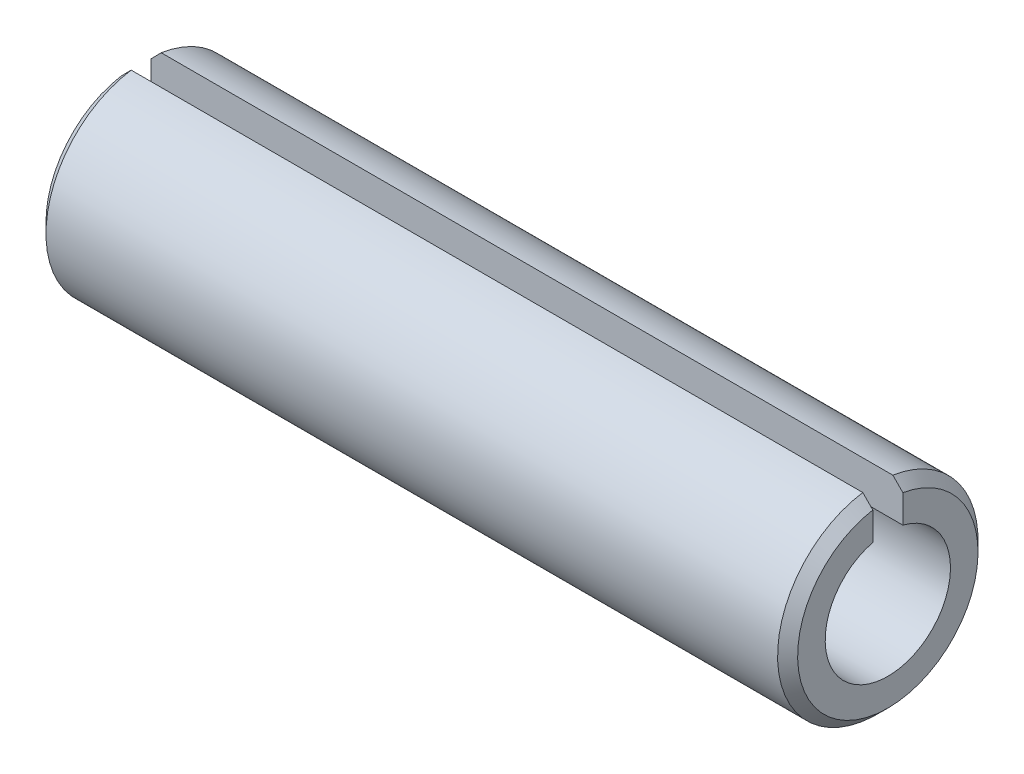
ISO-10303-21;
HEADER;
FILE_DESCRIPTION(('STEP AP214'),'2;1');
FILE_NAME('part.step','',(''),(''),'','','');
FILE_SCHEMA(('AUTOMOTIVE_DESIGN { 1 0 10303 214 1 1 1 1 }'));
ENDSEC;
DATA;
#1=APPLICATION_CONTEXT('core data for automotive mechanical design processes');
#2=APPLICATION_PROTOCOL_DEFINITION('international standard','automotive_design',2000,#1);
#3=PRODUCT_CONTEXT('',#1,'mechanical');
#4=PRODUCT('Part','Part','',(#3));
#5=PRODUCT_RELATED_PRODUCT_CATEGORY('part','',(#4));
#6=PRODUCT_DEFINITION_FORMATION('','',#4);
#7=PRODUCT_DEFINITION_CONTEXT('part definition',#1,'design');
#8=PRODUCT_DEFINITION('design','',#6,#7);
#9=PRODUCT_DEFINITION_SHAPE('','',#8);
#10=(LENGTH_UNIT() NAMED_UNIT(*) SI_UNIT(.MILLI.,.METRE.));
#11=(NAMED_UNIT(*) PLANE_ANGLE_UNIT() SI_UNIT($,.RADIAN.));
#12=(NAMED_UNIT(*) SI_UNIT($,.STERADIAN.) SOLID_ANGLE_UNIT());
#13=UNCERTAINTY_MEASURE_WITH_UNIT(LENGTH_MEASURE(1.E-05),#10,'distance_accuracy_value','');
#14=(GEOMETRIC_REPRESENTATION_CONTEXT(3) GLOBAL_UNCERTAINTY_ASSIGNED_CONTEXT((#13)) GLOBAL_UNIT_ASSIGNED_CONTEXT((#10,
#11,#12)) REPRESENTATION_CONTEXT('',''));
#15=CARTESIAN_POINT('',(0.,0.,0.));
#16=DIRECTION('',(0.,0.,1.));
#17=DIRECTION('',(1.,0.,0.));
#18=AXIS2_PLACEMENT_3D('',#15,#16,#17);
#19=CARTESIAN_POINT('',(0.,0.,0.));
#20=DIRECTION('',(-1.,0.,0.));
#21=DIRECTION('',(0.,0.,1.));
#22=AXIS2_PLACEMENT_3D('',#19,#20,#21);
#23=CYLINDRICAL_SURFACE('',#22,2.5);
#24=DIRECTION('',(-1.,0.,0.));
#25=VECTOR('',#24,1.);
#26=CARTESIAN_POINT('',(30.,2.42693221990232,0.6));
#27=LINE('',#26,#25);
#28=CARTESIAN_POINT('',(30.,2.42693221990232,0.6));
#29=VERTEX_POINT('',#28);
#30=CARTESIAN_POINT('',(0.,2.42693221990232,0.6));
#31=VERTEX_POINT('',#30);
#32=EDGE_CURVE('E50',#29,#31,#27,.T.);
#33=ORIENTED_EDGE('',*,*,#32,.F.);
#34=CARTESIAN_POINT('',(30.,0.,0.));
#35=DIRECTION('',(-1.,0.,0.));
#36=DIRECTION('',(0.,0.,1.));
#37=AXIS2_PLACEMENT_3D('',#34,#35,#36);
#38=CIRCLE('',#37,2.5);
#39=CARTESIAN_POINT('',(30.,2.42693221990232,-0.6));
#40=VERTEX_POINT('',#39);
#41=EDGE_CURVE('E92',#40,#29,#38,.T.);
#42=ORIENTED_EDGE('',*,*,#41,.F.);
#43=DIRECTION('',(-1.,0.,0.));
#44=VECTOR('',#43,1.);
#45=CARTESIAN_POINT('',(30.,2.42693221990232,-0.6));
#46=LINE('',#45,#44);
#47=CARTESIAN_POINT('',(0.,2.42693221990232,-0.6));
#48=VERTEX_POINT('',#47);
#49=EDGE_CURVE('E86',#40,#48,#46,.T.);
#50=ORIENTED_EDGE('',*,*,#49,.T.);
#51=CARTESIAN_POINT('',(0.,0.,0.));
#52=DIRECTION('',(-1.,0.,0.));
#53=DIRECTION('',(0.,0.,1.));
#54=AXIS2_PLACEMENT_3D('',#51,#52,#53);
#55=CIRCLE('',#54,2.5);
#56=EDGE_CURVE('E96',#48,#31,#55,.T.);
#57=ORIENTED_EDGE('',*,*,#56,.T.);
#58=EDGE_LOOP('',(#33,#42,#50,#57));
#59=FACE_BOUND('',#58,.T.);
#60=ADVANCED_FACE('F36',(#59),#23,.F.);
#61=CARTESIAN_POINT('',(30.,2.5,0.));
#62=DIRECTION('',(-1.,0.,0.));
#63=DIRECTION('',(0.,0.,1.));
#64=AXIS2_PLACEMENT_3D('',#61,#62,#63);
#65=PLANE('',#64);
#66=DIRECTION('',(0.,-1.,0.));
#67=VECTOR('',#66,1.);
#68=CARTESIAN_POINT('',(30.,3.95474398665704,0.6));
#69=LINE('',#68,#67);
#70=CARTESIAN_POINT('',(30.,3.54964786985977,0.6));
#71=VERTEX_POINT('',#70);
#72=EDGE_CURVE('E128',#71,#29,#69,.T.);
#73=ORIENTED_EDGE('',*,*,#72,.F.);
#74=CARTESIAN_POINT('',(30.,0.,0.));
#75=DIRECTION('',(-1.,0.,0.));
#76=DIRECTION('',(0.,0.,1.));
#77=AXIS2_PLACEMENT_3D('',#74,#75,#76);
#78=CIRCLE('',#77,3.6);
#79=CARTESIAN_POINT('',(30.,3.54964786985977,-0.6));
#80=VERTEX_POINT('',#79);
#81=EDGE_CURVE('E120',#80,#71,#78,.T.);
#82=ORIENTED_EDGE('',*,*,#81,.F.);
#83=DIRECTION('',(0.,-1.,0.));
#84=VECTOR('',#83,1.);
#85=CARTESIAN_POINT('',(30.,3.95474398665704,-0.6));
#86=LINE('',#85,#84);
#87=EDGE_CURVE('E129',#80,#40,#86,.T.);
#88=ORIENTED_EDGE('',*,*,#87,.T.);
#89=ORIENTED_EDGE('',*,*,#41,.T.);
#90=EDGE_LOOP('',(#73,#82,#88,#89));
#91=FACE_BOUND('',#90,.T.);
#92=ADVANCED_FACE('F126',(#91),#65,.F.);
#93=CARTESIAN_POINT('',(30.,0.,0.));
#94=DIRECTION('',(-1.,0.,0.));
#95=DIRECTION('',(0.,0.,1.));
#96=AXIS2_PLACEMENT_3D('',#93,#94,#95);
#97=CONICAL_SURFACE('',#96,3.6,0.785398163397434);
#98=CARTESIAN_POINT('',(27.873104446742,5.69537818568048,0.6));
#99=CARTESIAN_POINT('',(28.049423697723,5.51807770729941,0.6));
#100=CARTESIAN_POINT('',(28.2257027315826,5.34073717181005,0.6));
#101=CARTESIAN_POINT('',(28.5781365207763,4.98593500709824,0.6));
#102=CARTESIAN_POINT('',(28.7542912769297,4.8084733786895,0.6));
#103=CARTESIAN_POINT('',(29.1064277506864,4.45339301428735,0.6));
#104=CARTESIAN_POINT('',(29.2824094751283,4.27577428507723,0.6));
#105=CARTESIAN_POINT('',(29.6341356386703,3.92029946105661,0.6));
#106=CARTESIAN_POINT('',(29.809880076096,3.7424433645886,0.6));
#107=CARTESIAN_POINT('',(30.1610200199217,3.3863633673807,0.6));
#108=CARTESIAN_POINT('',(30.3364155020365,3.20813944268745,0.6));
#109=CARTESIAN_POINT('',(30.6866304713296,2.85113122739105,0.6));
#110=CARTESIAN_POINT('',(30.8614499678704,2.67234694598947,0.6));
#111=CARTESIAN_POINT('',(31.1229123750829,2.40341280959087,0.6));
#112=CARTESIAN_POINT('',(31.2099416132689,2.31363878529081,0.6));
#113=CARTESIAN_POINT('',(31.3836327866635,2.13373761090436,0.6));
#114=CARTESIAN_POINT('',(31.4702947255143,2.04361046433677,0.6));
#115=CARTESIAN_POINT('',(31.6430946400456,1.8628439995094,0.6));
#116=CARTESIAN_POINT('',(31.7292325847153,1.77220465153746,0.6));
#117=CARTESIAN_POINT('',(31.8578267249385,1.63566518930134,0.6));
#118=CARTESIAN_POINT('',(31.9005900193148,1.59005452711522,0.6));
#119=CARTESIAN_POINT('',(31.9858494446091,1.49858326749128,0.6));
#120=CARTESIAN_POINT('',(32.0283455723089,1.4527226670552,0.6));
#121=CARTESIAN_POINT('',(32.070676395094,1.40670916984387,0.6));
#122=B_SPLINE_CURVE_WITH_KNOTS('',3,(#98,#99,#100,#101,#102,#103,#104,#105,#106,#107,#108,#109,
#110,#111,#112,#113,#114,#115,#116,#117,#118,#119,#120,#121),.UNSPECIFIED.,.F.,.F.,(4,2,2,2,2,2,
2,2,2,2,2,4),(0.,0.750143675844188,1.50028235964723,2.25039009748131,3.0005031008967,
3.75066659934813,4.500817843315,4.87591865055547,5.25101572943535,5.62613479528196,
5.81370060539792,6.00126867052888),.UNSPECIFIED.);
#123=CARTESIAN_POINT('',(29.6,3.95474398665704,0.6));
#124=VERTEX_POINT('',#123);
#125=EDGE_CURVE('E102',#124,#71,#122,.T.);
#126=ORIENTED_EDGE('',*,*,#125,.F.);
#127=CARTESIAN_POINT('',(29.6,0.,0.));
#128=DIRECTION('',(-1.,0.,0.));
#129=DIRECTION('',(0.,0.,1.));
#130=AXIS2_PLACEMENT_3D('',#127,#128,#129);
#131=CIRCLE('',#130,4.);
#132=CARTESIAN_POINT('',(29.6,3.95474398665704,-0.6));
#133=VERTEX_POINT('',#132);
#134=EDGE_CURVE('E117',#133,#124,#131,.T.);
#135=ORIENTED_EDGE('',*,*,#134,.F.);
#136=CARTESIAN_POINT('',(27.873104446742,5.69537818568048,-0.6));
#137=CARTESIAN_POINT('',(28.049423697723,5.51807770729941,-0.6));
#138=CARTESIAN_POINT('',(28.2257027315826,5.34073717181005,-0.6));
#139=CARTESIAN_POINT('',(28.5781365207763,4.98593500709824,-0.6));
#140=CARTESIAN_POINT('',(28.7542912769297,4.8084733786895,-0.6));
#141=CARTESIAN_POINT('',(29.1064277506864,4.45339301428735,-0.6));
#142=CARTESIAN_POINT('',(29.2824094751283,4.27577428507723,-0.6));
#143=CARTESIAN_POINT('',(29.6341356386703,3.92029946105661,-0.6));
#144=CARTESIAN_POINT('',(29.809880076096,3.7424433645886,-0.6));
#145=CARTESIAN_POINT('',(30.1610200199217,3.3863633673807,-0.6));
#146=CARTESIAN_POINT('',(30.3364155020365,3.20813944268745,-0.6));
#147=CARTESIAN_POINT('',(30.6866304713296,2.85113122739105,-0.6));
#148=CARTESIAN_POINT('',(30.8614499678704,2.67234694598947,-0.6));
#149=CARTESIAN_POINT('',(31.1229123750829,2.40341280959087,-0.6));
#150=CARTESIAN_POINT('',(31.2099416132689,2.31363878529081,-0.6));
#151=CARTESIAN_POINT('',(31.3836327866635,2.13373761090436,-0.6));
#152=CARTESIAN_POINT('',(31.4702947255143,2.04361046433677,-0.6));
#153=CARTESIAN_POINT('',(31.6430946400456,1.8628439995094,-0.6));
#154=CARTESIAN_POINT('',(31.7292325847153,1.77220465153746,-0.6));
#155=CARTESIAN_POINT('',(31.8578267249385,1.63566518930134,-0.6));
#156=CARTESIAN_POINT('',(31.9005900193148,1.59005452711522,-0.6));
#157=CARTESIAN_POINT('',(31.9858494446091,1.49858326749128,-0.6));
#158=CARTESIAN_POINT('',(32.0283455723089,1.4527226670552,-0.6));
#159=CARTESIAN_POINT('',(32.070676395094,1.40670916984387,-0.6));
#160=B_SPLINE_CURVE_WITH_KNOTS('',3,(#136,#137,#138,#139,#140,#141,#142,#143,#144,#145,#146,
#147,#148,#149,#150,#151,#152,#153,#154,#155,#156,#157,#158,#159),.UNSPECIFIED.,.F.,.F.,(4,2,2,
2,2,2,2,2,2,2,2,4),(0.,0.750143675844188,1.50028235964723,2.25039009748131,3.0005031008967,
3.75066659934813,4.500817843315,4.87591865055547,5.25101572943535,5.62613479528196,
5.81370060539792,6.00126867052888),.UNSPECIFIED.);
#161=EDGE_CURVE('E145',#133,#80,#160,.T.);
#162=ORIENTED_EDGE('',*,*,#161,.T.);
#163=ORIENTED_EDGE('',*,*,#81,.T.);
#164=EDGE_LOOP('',(#126,#135,#162,#163));
#165=FACE_BOUND('',#164,.T.);
#166=ADVANCED_FACE('F167',(#165),#97,.T.);
#167=CARTESIAN_POINT('',(0.,0.,0.));
#168=DIRECTION('',(-1.,0.,0.));
#169=DIRECTION('',(0.,0.,1.));
#170=AXIS2_PLACEMENT_3D('',#167,#168,#169);
#171=CYLINDRICAL_SURFACE('',#170,4.);
#172=DIRECTION('',(-1.,0.,0.));
#173=VECTOR('',#172,1.);
#174=CARTESIAN_POINT('',(30.,3.95474398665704,0.6));
#175=LINE('',#174,#173);
#176=CARTESIAN_POINT('',(0.4,3.95474398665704,0.6));
#177=VERTEX_POINT('',#176);
#178=EDGE_CURVE('E136',#124,#177,#175,.T.);
#179=ORIENTED_EDGE('',*,*,#178,.T.);
#180=CARTESIAN_POINT('',(0.399999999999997,0.,0.));
#181=DIRECTION('',(-1.,0.,0.));
#182=DIRECTION('',(0.,0.,1.));
#183=AXIS2_PLACEMENT_3D('',#180,#181,#182);
#184=CIRCLE('',#183,4.);
#185=CARTESIAN_POINT('',(0.4,3.95474398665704,-0.6));
#186=VERTEX_POINT('',#185);
#187=EDGE_CURVE('E104',#186,#177,#184,.T.);
#188=ORIENTED_EDGE('',*,*,#187,.F.);
#189=DIRECTION('',(-1.,0.,0.));
#190=VECTOR('',#189,1.);
#191=CARTESIAN_POINT('',(30.,3.95474398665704,-0.6));
#192=LINE('',#191,#190);
#193=EDGE_CURVE('E98',#133,#186,#192,.T.);
#194=ORIENTED_EDGE('',*,*,#193,.F.);
#195=ORIENTED_EDGE('',*,*,#134,.T.);
#196=EDGE_LOOP('',(#179,#188,#194,#195));
#197=FACE_BOUND('',#196,.T.);
#198=ADVANCED_FACE('F171',(#197),#171,.T.);
#199=CARTESIAN_POINT('',(0.399999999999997,0.,0.));
#200=DIRECTION('',(1.,0.,0.));
#201=DIRECTION('',(0.,0.,-1.));
#202=AXIS2_PLACEMENT_3D('',#199,#200,#201);
#203=CONICAL_SURFACE('',#202,4.,0.785398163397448);
#204=CARTESIAN_POINT('',(-2.07067639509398,1.40670916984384,0.6));
#205=CARTESIAN_POINT('',(-2.02011415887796,1.46166506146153,0.6));
#206=CARTESIAN_POINT('',(-1.9693200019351,1.51640610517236,0.6));
#207=CARTESIAN_POINT('',(-1.86736787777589,1.62554685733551,0.6));
#208=CARTESIAN_POINT('',(-1.81620991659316,1.67994657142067,0.6));
#209=CARTESIAN_POINT('',(-1.66234187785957,1.84276470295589,0.6));
#210=CARTESIAN_POINT('',(-1.55923365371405,1.95080641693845,0.6));
#211=CARTESIAN_POINT('',(-1.35237956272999,2.16626307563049,0.6));
#212=CARTESIAN_POINT('',(-1.24863373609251,2.27367805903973,0.6));
#213=CARTESIAN_POINT('',(-1.04071524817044,2.48809612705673,0.6));
#214=CARTESIAN_POINT('',(-0.936542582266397,2.59509920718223,0.6));
#215=CARTESIAN_POINT('',(-0.69150769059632,2.84610384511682,0.6));
#216=CARTESIAN_POINT('',(-0.55052569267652,2.98998839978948,0.6));
#217=CARTESIAN_POINT('',(-0.268216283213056,3.27742366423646,0.6));
#218=CARTESIAN_POINT('',(-0.126888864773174,3.42097436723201,0.6));
#219=CARTESIAN_POINT('',(0.190127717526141,3.74245168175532,0.6));
#220=CARTESIAN_POINT('',(0.365880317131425,3.92031572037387,0.6));
#221=CARTESIAN_POINT('',(0.717623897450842,4.27580788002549,0.6));
#222=CARTESIAN_POINT('',(0.893614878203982,4.45343600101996,0.6));
#223=CARTESIAN_POINT('',(1.24575266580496,4.80851768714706,0.6));
#224=CARTESIAN_POINT('',(1.42189946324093,4.9859712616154,0.6));
#225=CARTESIAN_POINT('',(1.77431596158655,5.34075596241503,0.6));
#226=CARTESIAN_POINT('',(1.95058566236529,5.51808708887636,0.6));
#227=CARTESIAN_POINT('',(2.12689555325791,5.69537818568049,0.6));
#228=B_SPLINE_CURVE_WITH_KNOTS('',3,(#204,#205,#206,#207,#208,#209,#210,#211,#212,#213,#214,
#215,#216,#217,#218,#219,#220,#221,#222,#223,#224,#225,#226,#227),.UNSPECIFIED.,.F.,.F.,(4,2,2,
2,2,2,2,2,2,2,2,4),(0.,0.224029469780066,0.448055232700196,0.896089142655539,1.3440950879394,
1.79210589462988,2.39642954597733,3.00076536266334,3.75091253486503,4.50105982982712,
5.25116454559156,6.00126846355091),.UNSPECIFIED.);
#229=CARTESIAN_POINT('',(0.,3.54964786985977,0.6));
#230=VERTEX_POINT('',#229);
#231=EDGE_CURVE('E106',#230,#177,#228,.T.);
#232=ORIENTED_EDGE('',*,*,#231,.F.);
#233=CARTESIAN_POINT('',(0.,0.,0.));
#234=DIRECTION('',(-1.,0.,0.));
#235=DIRECTION('',(0.,0.,1.));
#236=AXIS2_PLACEMENT_3D('',#233,#234,#235);
#237=CIRCLE('',#236,3.6);
#238=CARTESIAN_POINT('',(0.,3.54964786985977,-0.6));
#239=VERTEX_POINT('',#238);
#240=EDGE_CURVE('E101',#239,#230,#237,.T.);
#241=ORIENTED_EDGE('',*,*,#240,.F.);
#242=CARTESIAN_POINT('',(-2.07067639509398,1.40670916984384,-0.6));
#243=CARTESIAN_POINT('',(-2.02011415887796,1.46166506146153,-0.6));
#244=CARTESIAN_POINT('',(-1.9693200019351,1.51640610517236,-0.6));
#245=CARTESIAN_POINT('',(-1.86736787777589,1.62554685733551,-0.6));
#246=CARTESIAN_POINT('',(-1.81620991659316,1.67994657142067,-0.6));
#247=CARTESIAN_POINT('',(-1.66234187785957,1.84276470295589,-0.6));
#248=CARTESIAN_POINT('',(-1.55923365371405,1.95080641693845,-0.6));
#249=CARTESIAN_POINT('',(-1.35237956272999,2.16626307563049,-0.6));
#250=CARTESIAN_POINT('',(-1.24863373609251,2.27367805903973,-0.6));
#251=CARTESIAN_POINT('',(-1.04071524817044,2.48809612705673,-0.6));
#252=CARTESIAN_POINT('',(-0.936542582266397,2.59509920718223,-0.6));
#253=CARTESIAN_POINT('',(-0.69150769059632,2.84610384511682,-0.6));
#254=CARTESIAN_POINT('',(-0.55052569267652,2.98998839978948,-0.6));
#255=CARTESIAN_POINT('',(-0.268216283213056,3.27742366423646,-0.6));
#256=CARTESIAN_POINT('',(-0.126888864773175,3.42097436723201,-0.6));
#257=CARTESIAN_POINT('',(0.190127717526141,3.74245168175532,-0.6));
#258=CARTESIAN_POINT('',(0.365880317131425,3.92031572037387,-0.6));
#259=CARTESIAN_POINT('',(0.717623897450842,4.27580788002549,-0.6));
#260=CARTESIAN_POINT('',(0.893614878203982,4.45343600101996,-0.6));
#261=CARTESIAN_POINT('',(1.24575266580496,4.80851768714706,-0.6));
#262=CARTESIAN_POINT('',(1.42189946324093,4.9859712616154,-0.6));
#263=CARTESIAN_POINT('',(1.77431596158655,5.34075596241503,-0.6));
#264=CARTESIAN_POINT('',(1.95058566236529,5.51808708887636,-0.6));
#265=CARTESIAN_POINT('',(2.1268955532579,5.69537818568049,-0.6));
#266=B_SPLINE_CURVE_WITH_KNOTS('',3,(#242,#243,#244,#245,#246,#247,#248,#249,#250,#251,#252,
#253,#254,#255,#256,#257,#258,#259,#260,#261,#262,#263,#264,#265),.UNSPECIFIED.,.F.,.F.,(4,2,2,
2,2,2,2,2,2,2,2,4),(0.,0.224029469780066,0.448055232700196,0.896089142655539,1.3440950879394,
1.79210589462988,2.39642954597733,3.00076536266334,3.75091253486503,4.50105982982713,
5.25116454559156,6.00126846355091),.UNSPECIFIED.);
#267=EDGE_CURVE('E57',#239,#186,#266,.T.);
#268=ORIENTED_EDGE('',*,*,#267,.T.);
#269=ORIENTED_EDGE('',*,*,#187,.T.);
#270=EDGE_LOOP('',(#232,#241,#268,#269));
#271=FACE_BOUND('',#270,.T.);
#272=ADVANCED_FACE('F149',(#271),#203,.T.);
#273=CARTESIAN_POINT('',(0.,2.5,0.));
#274=DIRECTION('',(-1.,0.,0.));
#275=DIRECTION('',(0.,0.,1.));
#276=AXIS2_PLACEMENT_3D('',#273,#274,#275);
#277=PLANE('',#276);
#278=ORIENTED_EDGE('',*,*,#240,.T.);
#279=DIRECTION('',(0.,-1.,0.));
#280=VECTOR('',#279,1.);
#281=CARTESIAN_POINT('',(0.,2.5,0.6));
#282=LINE('',#281,#280);
#283=EDGE_CURVE('E11',#230,#31,#282,.T.);
#284=ORIENTED_EDGE('',*,*,#283,.T.);
#285=ORIENTED_EDGE('',*,*,#56,.F.);
#286=DIRECTION('',(0.,-1.,0.));
#287=VECTOR('',#286,1.);
#288=CARTESIAN_POINT('',(0.,2.5,-0.6));
#289=LINE('',#288,#287);
#290=EDGE_CURVE('E43',#239,#48,#289,.T.);
#291=ORIENTED_EDGE('',*,*,#290,.F.);
#292=EDGE_LOOP('',(#278,#284,#285,#291));
#293=FACE_BOUND('',#292,.T.);
#294=ADVANCED_FACE('F100',(#293),#277,.T.);
#295=CARTESIAN_POINT('',(30.,3.95474398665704,-0.6));
#296=DIRECTION('',(0.,0.,-1.));
#297=DIRECTION('',(0.,1.,0.));
#298=AXIS2_PLACEMENT_3D('',#295,#296,#297);
#299=PLANE('',#298);
#300=ORIENTED_EDGE('',*,*,#193,.T.);
#301=ORIENTED_EDGE('',*,*,#267,.F.);
#302=ORIENTED_EDGE('',*,*,#290,.T.);
#303=ORIENTED_EDGE('',*,*,#49,.F.);
#304=ORIENTED_EDGE('',*,*,#87,.F.);
#305=ORIENTED_EDGE('',*,*,#161,.F.);
#306=EDGE_LOOP('',(#300,#301,#302,#303,#304,#305));
#307=FACE_BOUND('',#306,.T.);
#308=ADVANCED_FACE('F85',(#307),#299,.F.);
#309=CARTESIAN_POINT('',(30.,3.95474398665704,0.6));
#310=DIRECTION('',(0.,0.,-1.));
#311=DIRECTION('',(0.,1.,0.));
#312=AXIS2_PLACEMENT_3D('',#309,#310,#311);
#313=PLANE('',#312);
#314=ORIENTED_EDGE('',*,*,#125,.T.);
#315=ORIENTED_EDGE('',*,*,#72,.T.);
#316=ORIENTED_EDGE('',*,*,#32,.T.);
#317=ORIENTED_EDGE('',*,*,#283,.F.);
#318=ORIENTED_EDGE('',*,*,#231,.T.);
#319=ORIENTED_EDGE('',*,*,#178,.F.);
#320=EDGE_LOOP('',(#314,#315,#316,#317,#318,#319));
#321=FACE_BOUND('',#320,.T.);
#322=ADVANCED_FACE('F155',(#321),#313,.T.);
#323=CLOSED_SHELL('',(#60,#92,#166,#198,#272,#294,#308,#322));
#324=MANIFOLD_SOLID_BREP('B2',#323);
#325=ADVANCED_BREP_SHAPE_REPRESENTATION('',(#18,#324),#14);
#326=SHAPE_DEFINITION_REPRESENTATION(#9,#325);
ENDSEC;
END-ISO-10303-21;
